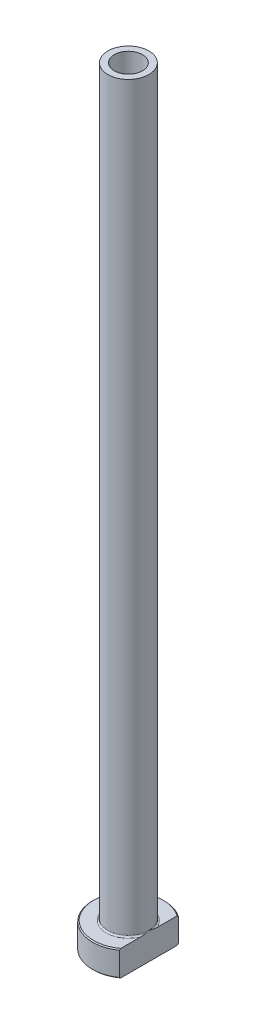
from build123d import *

# Parameters (mm, degrees)
FILLET1_R          = 0.3
CHAMFER1_SIZE      = 0.2
CUT_EXTRUDE1_DEPTH = 151.326311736
CHAMFER2_SIZE      = 0.5


with BuildPart() as part:
    # Sketch1 → Revolve1 (revolve)
    with BuildSketch(Plane.XY, mode=Mode.PRIVATE) as revolve1_sk:
        Polygon((-2.75, 150), (-4, 150), (-4, 5), (-7, 5), (-7, 0), (-3, 0), (-3, 93), (-2.75, 105), align=None)
    revolve(revolve1_sk.sketch.rotate(Axis((0, 92.187680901, 0), (0, -1, 0)), 270), axis=Axis((0, 92.187680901, 0), (0, -1, 0)))

    # Fillet1
    fillet1_edges = [part.edges().sort_by_distance(p)[0] for p in [
        (0, 5, -4),
    ]]
    fillet(fillet1_edges, radius=FILLET1_R)

    # Chamfer1
    chamfer1_edges = [part.edges().sort_by_distance(p)[0] for p in [
        (0, 0, -7),
        (0, 5, -7),
    ]]
    chamfer(chamfer1_edges, length=CHAMFER1_SIZE)

    # Sketch2 → Cut-Extrude1 (cut, through all)
    with BuildSketch(Plane.XZ):
        with BuildLine():
            Line((4, 5.744562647), (4, -5.744562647))
            ThreePointArc((4, -5.744562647), (7, 0), (4, 5.744562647))
        make_face()
    extrude(amount=-CUT_EXTRUDE1_DEPTH, mode=Mode.SUBTRACT)

    # Chamfer2
    chamfer2_edges = [part.edges().sort_by_distance(p)[0] for p in [
        (0, 0, -3),
    ]]
    chamfer(chamfer2_edges, length=CHAMFER2_SIZE)


solid = part.part
